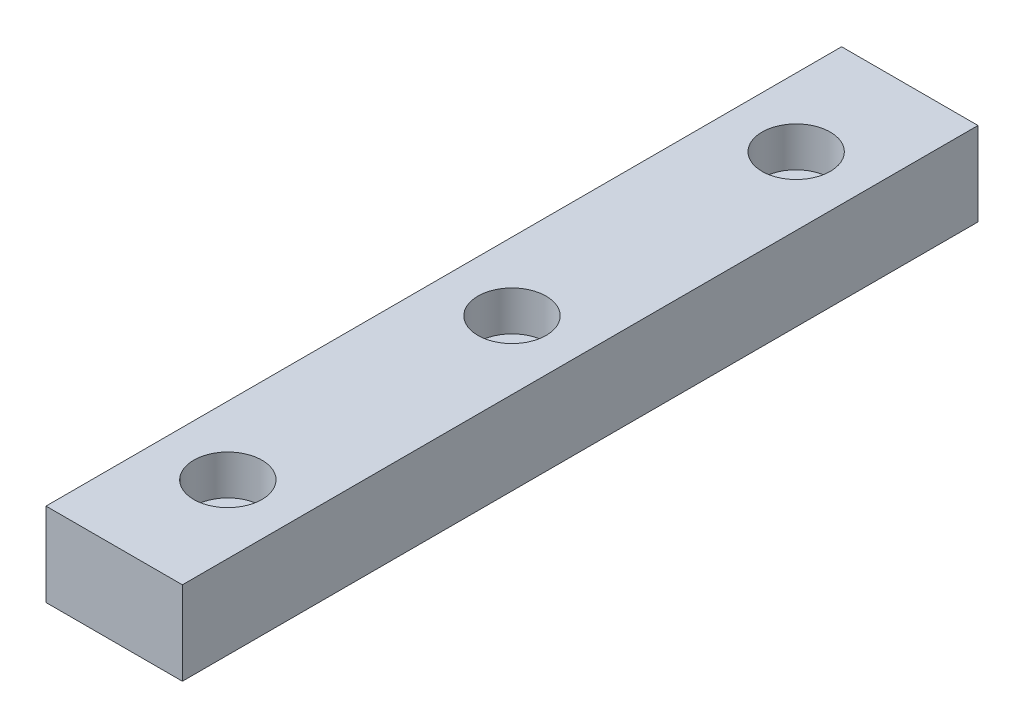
from build123d import *

# Parameters (mm, degrees)
SKETCH_1_W          = 12
SKETCH_1_H          = 7.35
EXTRUDE_1_DEPTH     = 70
SKETCH_2_R          = 1.75
CUT_EXTRUDE_1_DEPTH = 70
SKETCH_4_R          = 3
CUT_EXTRUDE_2_DEPTH = 3.5


with BuildPart() as part:
    # Sketch 1 → Extrude 1 (new body)
    with BuildSketch(Plane.XY):
        with Locations((6, 3.675)):
            Rectangle(SKETCH_1_W, SKETCH_1_H)
    extrude(amount=EXTRUDE_1_DEPTH)

    # Sketch 2 → Cut-Extrude 1 (cut)
    with BuildSketch(Plane(origin=(0, 7.35, 0), x_dir=(1, 0, 0), z_dir=(0, 1, 0))):
        with Locations(Location((6, -60, 0), (0, 0, 270))):
            Circle(SKETCH_2_R)
        with Locations(Location((6, -35, 0), (0, 0, 270))):
            Circle(SKETCH_2_R)
        with Locations(Location((6, -10, 0), (0, 0, 270))):
            Circle(SKETCH_2_R)
    extrude(amount=-CUT_EXTRUDE_1_DEPTH, mode=Mode.SUBTRACT)

    # Sketch 4 → Cut-Extrude 2 (cut)
    with BuildSketch(Plane(origin=(0, 7.35, 0), x_dir=(1, 0, 0), z_dir=(0, 1, 0))):
        with Locations(Location((6, -60, 0), (0, 0, 270))):
            Circle(SKETCH_4_R)
        with Locations(Location((6, -35, 0), (0, 0, 270))):
            Circle(SKETCH_4_R)
        with Locations(Location((6, -10, 0), (0, 0, 270))):
            Circle(SKETCH_4_R)
    extrude(amount=-CUT_EXTRUDE_2_DEPTH, mode=Mode.SUBTRACT)


solid = part.part
